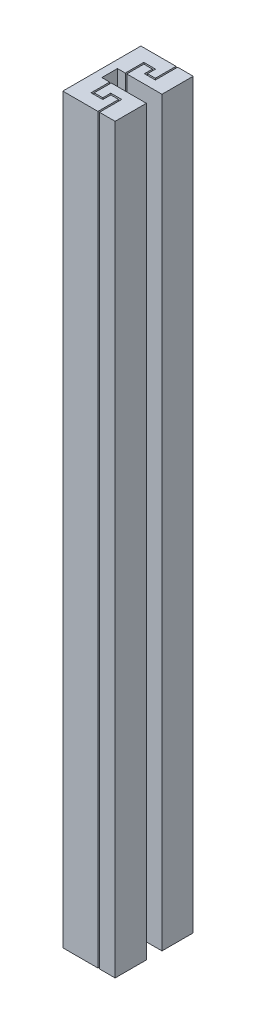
from build123d import *

# Parameters (mm, degrees)
SKETCH1_W             = 11.43
SKETCH1_H             = 25.4
BOSS_EXTRUDE1_DEPTH   = 241.3
CUT_EXTRUDE1_DEPTH    = 241.3
BOSS_EXTRUDE2_DEPTH   = 241.3
BOSS_EXTRUDE2_2_DEPTH = 241.3


with BuildPart() as part:
    # Sketch1 → Boss-Extrude1 (new body)
    with BuildSketch(Plane(origin=(0, 0, 0), x_dir=(1, 0, 0), z_dir=(0, 1, 0))):
        Rectangle(SKETCH1_W, SKETCH1_H)
    extrude(amount=BOSS_EXTRUDE1_DEPTH)

    # Sketch3 → Cut-Extrude1 (cut)
    with BuildSketch(Plane.XZ):
        Polygon((-3.175, -2.54), (-3.175, 2.54), (-0.635, 2.54), (-0.635, 8.57982308), (3.175, 8.57982308), (3.175, 5.980073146), (6.985, 5.980073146), (6.985, 9.662200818), (13.335, 9.662200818), (13.335, 0), (13.335, -9.662200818), (6.985, -9.662200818), (6.985, -5.980073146), (3.175, -5.980073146), (3.175, -8.57982308), (-0.635, -8.57982308), (-0.635, -2.54), align=None)
    extrude(amount=-CUT_EXTRUDE1_DEPTH, mode=Mode.SUBTRACT)


with BuildPart() as body_2:
    # Sketch5 → Boss-Extrude2 (new body)
    with BuildSketch(Plane(origin=(0, 0, 0), x_dir=(1, 0, 0), z_dir=(0, 1, 0))):
        Polygon((-0.127, 2.54), (-0.127, 8.07182308), (2.667, 8.07182308), (2.667, 5.472073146), (6.223, 5.472073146), (6.223, 12.7), (11.303, 12.7), (11.303, 2.54), align=None)
    extrude(amount=BOSS_EXTRUDE2_DEPTH)


with BuildPart() as body_3:
    # Sketch5 → Boss-Extrude2 2 (new body)
    with BuildSketch(Plane(origin=(0, 0, 0), x_dir=(1, 0, 0), z_dir=(0, 1, 0))):
        Polygon((11.303, -2.54), (11.303, -12.7), (6.223, -12.7), (6.223, -5.472073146), (2.667, -5.472073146), (2.667, -8.07182308), (-0.127, -8.07182308), (-0.127, -2.54), align=None)
    extrude(amount=BOSS_EXTRUDE2_2_DEPTH)


solid = Compound([part.part, body_2.part, body_3.part])
